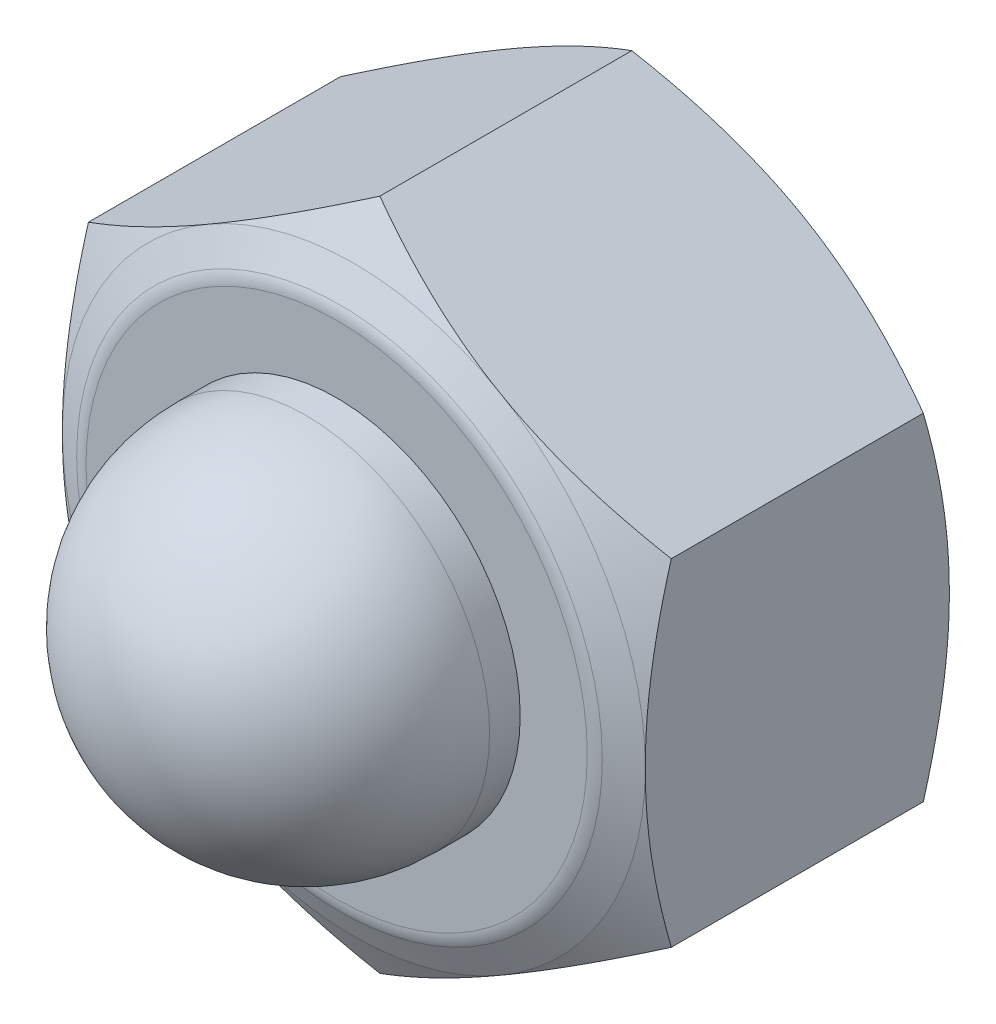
ISO-10303-21;
HEADER;
FILE_DESCRIPTION(('STEP AP214'),'2;1');
FILE_NAME('part.step','',(''),(''),'','','');
FILE_SCHEMA(('AUTOMOTIVE_DESIGN { 1 0 10303 214 1 1 1 1 }'));
ENDSEC;
DATA;
#1=APPLICATION_CONTEXT('core data for automotive mechanical design processes');
#2=APPLICATION_PROTOCOL_DEFINITION('international standard','automotive_design',2000,#1);
#3=PRODUCT_CONTEXT('',#1,'mechanical');
#4=PRODUCT('Part','Part','',(#3));
#5=PRODUCT_RELATED_PRODUCT_CATEGORY('part','',(#4));
#6=PRODUCT_DEFINITION_FORMATION('','',#4);
#7=PRODUCT_DEFINITION_CONTEXT('part definition',#1,'design');
#8=PRODUCT_DEFINITION('design','',#6,#7);
#9=PRODUCT_DEFINITION_SHAPE('','',#8);
#10=(LENGTH_UNIT() NAMED_UNIT(*) SI_UNIT(.MILLI.,.METRE.));
#11=(NAMED_UNIT(*) PLANE_ANGLE_UNIT() SI_UNIT($,.RADIAN.));
#12=(NAMED_UNIT(*) SI_UNIT($,.STERADIAN.) SOLID_ANGLE_UNIT());
#13=UNCERTAINTY_MEASURE_WITH_UNIT(LENGTH_MEASURE(1.E-05),#10,'distance_accuracy_value','');
#14=(GEOMETRIC_REPRESENTATION_CONTEXT(3) GLOBAL_UNCERTAINTY_ASSIGNED_CONTEXT((#13)) GLOBAL_UNIT_ASSIGNED_CONTEXT((#10,
#11,#12)) REPRESENTATION_CONTEXT('',''));
#15=CARTESIAN_POINT('',(0.,0.,0.));
#16=DIRECTION('',(0.,0.,1.));
#17=DIRECTION('',(1.,0.,0.));
#18=AXIS2_PLACEMENT_3D('',#15,#16,#17);
#19=CARTESIAN_POINT('',(0.,0.,-19.875));
#20=DIRECTION('',(0.,0.,1.));
#21=DIRECTION('',(1.,0.,0.));
#22=AXIS2_PLACEMENT_3D('',#19,#20,#21);
#23=CYLINDRICAL_SURFACE('',#22,11.1125);
#24=CARTESIAN_POINT('',(0.,0.,3.125));
#25=DIRECTION('',(0.,0.,1.));
#26=DIRECTION('',(1.,0.,0.));
#27=AXIS2_PLACEMENT_3D('',#24,#25,#26);
#28=CIRCLE('',#27,11.1125);
#29=CARTESIAN_POINT('',(11.1125,0.,3.125));
#30=VERTEX_POINT('',#29);
#31=EDGE_CURVE('E308',#30,#30,#28,.T.);
#32=CARTESIAN_POINT('',(0.,0.,-19.3244443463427));
#33=DIRECTION('',(0.,0.,-1.));
#34=DIRECTION('',(-1.,0.,0.));
#35=AXIS2_PLACEMENT_3D('',#32,#33,#34);
#36=CIRCLE('',#35,11.1125);
#37=CARTESIAN_POINT('',(11.1125,0.,-19.3244443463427));
#38=VERTEX_POINT('',#37);
#39=EDGE_CURVE('E42',#38,#38,#36,.F.);
#40=CARTESIAN_POINT('',(11.1125,0.,3.125));
#41=CARTESIAN_POINT('',(11.1125,0.,2.89115162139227));
#42=CARTESIAN_POINT('',(11.1125,0.,2.65730324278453));
#43=CARTESIAN_POINT('',(11.1125,0.,2.18960648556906));
#44=CARTESIAN_POINT('',(11.1125,0.,1.95575810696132));
#45=CARTESIAN_POINT('',(11.1125,0.,1.48806134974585));
#46=CARTESIAN_POINT('',(11.1125,0.,1.25421297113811));
#47=CARTESIAN_POINT('',(11.1125,0.,0.786516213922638));
#48=CARTESIAN_POINT('',(11.1125,0.,0.5526678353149));
#49=CARTESIAN_POINT('',(11.1125,0.,0.0849710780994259));
#50=CARTESIAN_POINT('',(11.1125,0.,-0.148877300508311));
#51=CARTESIAN_POINT('',(11.1125,0.,-0.616574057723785));
#52=CARTESIAN_POINT('',(11.1125,0.,-0.850422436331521));
#53=CARTESIAN_POINT('',(11.1125,0.,-1.31811919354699));
#54=CARTESIAN_POINT('',(11.1125,0.,-1.55196757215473));
#55=CARTESIAN_POINT('',(11.1125,0.,-2.0196643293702));
#56=CARTESIAN_POINT('',(11.1125,0.,-2.25351270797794));
#57=CARTESIAN_POINT('',(11.1125,0.,-2.72120946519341));
#58=CARTESIAN_POINT('',(11.1125,0.,-2.95505784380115));
#59=CARTESIAN_POINT('',(11.1125,0.,-3.42275460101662));
#60=CARTESIAN_POINT('',(11.1125,0.,-3.65660297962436));
#61=CARTESIAN_POINT('',(11.1125,0.,-4.12429973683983));
#62=CARTESIAN_POINT('',(11.1125,0.,-4.35814811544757));
#63=CARTESIAN_POINT('',(11.1125,0.,-4.82584487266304));
#64=CARTESIAN_POINT('',(11.1125,0.,-5.05969325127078));
#65=CARTESIAN_POINT('',(11.1125,0.,-5.52739000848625));
#66=CARTESIAN_POINT('',(11.1125,0.,-5.76123838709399));
#67=CARTESIAN_POINT('',(11.1125,0.,-6.22893514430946));
#68=CARTESIAN_POINT('',(11.1125,0.,-6.4627835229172));
#69=CARTESIAN_POINT('',(11.1125,0.,-6.93048028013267));
#70=CARTESIAN_POINT('',(11.1125,0.,-7.16432865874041));
#71=CARTESIAN_POINT('',(11.1125,0.,-7.63202541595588));
#72=CARTESIAN_POINT('',(11.1125,0.,-7.86587379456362));
#73=CARTESIAN_POINT('',(11.1125,0.,-8.33357055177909));
#74=CARTESIAN_POINT('',(11.1125,0.,-8.56741893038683));
#75=CARTESIAN_POINT('',(11.1125,0.,-9.0351156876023));
#76=CARTESIAN_POINT('',(11.1125,0.,-9.26896406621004));
#77=CARTESIAN_POINT('',(11.1125,0.,-9.73666082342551));
#78=CARTESIAN_POINT('',(11.1125,0.,-9.97050920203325));
#79=CARTESIAN_POINT('',(11.1125,0.,-10.4382059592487));
#80=CARTESIAN_POINT('',(11.1125,0.,-10.6720543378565));
#81=CARTESIAN_POINT('',(11.1125,0.,-11.1397510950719));
#82=CARTESIAN_POINT('',(11.1125,0.,-11.3735994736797));
#83=CARTESIAN_POINT('',(11.1125,0.,-11.8412962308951));
#84=CARTESIAN_POINT('',(11.1125,0.,-12.0751446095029));
#85=CARTESIAN_POINT('',(11.1125,0.,-12.5428413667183));
#86=CARTESIAN_POINT('',(11.1125,0.,-12.7766897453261));
#87=CARTESIAN_POINT('',(11.1125,0.,-13.2443865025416));
#88=CARTESIAN_POINT('',(11.1125,0.,-13.4782348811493));
#89=CARTESIAN_POINT('',(11.1125,0.,-13.9459316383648));
#90=CARTESIAN_POINT('',(11.1125,0.,-14.1797800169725));
#91=CARTESIAN_POINT('',(11.1125,0.,-14.647476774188));
#92=CARTESIAN_POINT('',(11.1125,0.,-14.8813251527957));
#93=CARTESIAN_POINT('',(11.1125,0.,-15.3490219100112));
#94=CARTESIAN_POINT('',(11.1125,0.,-15.5828702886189));
#95=CARTESIAN_POINT('',(11.1125,0.,-16.0505670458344));
#96=CARTESIAN_POINT('',(11.1125,0.,-16.2844154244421));
#97=CARTESIAN_POINT('',(11.1125,0.,-16.7521121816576));
#98=CARTESIAN_POINT('',(11.1125,0.,-16.9859605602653));
#99=CARTESIAN_POINT('',(11.1125,0.,-17.4536573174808));
#100=CARTESIAN_POINT('',(11.1125,0.,-17.6875056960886));
#101=CARTESIAN_POINT('',(11.1125,0.,-18.155202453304));
#102=CARTESIAN_POINT('',(11.1125,0.,-18.3890508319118));
#103=CARTESIAN_POINT('',(11.1125,0.,-18.8567475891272));
#104=CARTESIAN_POINT('',(11.1125,0.,-19.090595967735));
#105=CARTESIAN_POINT('',(11.1125,0.,-19.3244443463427));
#106=B_SPLINE_CURVE_WITH_KNOTS('',3,(#40,#41,#42,#43,#44,#45,#46,#47,#48,#49,#50,#51,#52,#53,
#54,#55,#56,#57,#58,#59,#60,#61,#62,#63,#64,#65,#66,#67,#68,#69,#70,#71,#72,#73,#74,#75,#76,#77,
#78,#79,#80,#81,#82,#83,#84,#85,#86,#87,#88,#89,#90,#91,#92,#93,#94,#95,#96,#97,#98,#99,#100,
#101,#102,#103,#104,#105),.UNSPECIFIED.,.F.,.F.,(4,2,2,2,2,2,2,2,2,2,2,2,2,2,2,2,2,2,2,2,2,2,2,
2,2,2,2,2,2,2,2,2,4),(0.,0.701545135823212,1.40309027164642,2.10463540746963,2.80618054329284,
3.50772567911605,4.20927081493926,4.91081595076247,5.61236108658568,6.31390622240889,
7.0154513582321,7.71699649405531,8.41854162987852,9.12008676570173,9.82163190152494,
10.5231770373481,11.2247221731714,11.9262673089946,12.6278124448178,13.329357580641,
14.0309027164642,14.7324478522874,15.4339929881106,16.1355381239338,16.837083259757,
17.5386283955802,18.2401735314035,18.9417186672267,19.6432638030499,20.3448089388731,
21.0463540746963,21.7478992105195,22.4494443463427),.UNSPECIFIED.);
#107=EDGE_CURVE('BSEAM37',#30,#38,#106,.T.);
#108=ORIENTED_EDGE('',*,*,#31,.T.);
#109=ORIENTED_EDGE('',*,*,#39,.F.);
#110=ORIENTED_EDGE('',*,*,#107,.T.);
#111=ORIENTED_EDGE('',*,*,#107,.F.);
#112=EDGE_LOOP('',(#108,#110,#109,#111));
#113=FACE_BOUND('',#112,.T.);
#114=ADVANCED_FACE('F37',(#113),#23,.F.);
#115=CARTESIAN_POINT('',(0.,21.9970452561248,-19.875));
#116=DIRECTION('',(-0.500000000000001,0.866025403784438,0.));
#117=DIRECTION('',(-0.866025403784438,-0.500000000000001,0.));
#118=AXIS2_PLACEMENT_3D('',#115,#116,#117);
#119=PLANE('',#118);
#120=DIRECTION('',(0.,0.,1.));
#121=VECTOR('',#120,1.);
#122=CARTESIAN_POINT('',(-19.05,10.9985226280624,-19.875));
#123=LINE('',#122,#121);
#124=CARTESIAN_POINT('',(-19.05,10.9985226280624,-18.1735226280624));
#125=VERTEX_POINT('',#124);
#126=CARTESIAN_POINT('',(-19.05,10.9985226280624,-1.70147737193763));
#127=VERTEX_POINT('',#126);
#128=EDGE_CURVE('E585',#125,#127,#123,.T.);
#129=ORIENTED_EDGE('',*,*,#128,.T.);
#130=CARTESIAN_POINT('',(-19.0502,10.9984071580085,-1.70154403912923));
#131=CARTESIAN_POINT('',(-18.6314889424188,11.2401500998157,-1.56198341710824));
#132=CARTESIAN_POINT('',(-18.2111446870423,11.4828359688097,-1.42875584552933));
#133=CARTESIAN_POINT('',(-17.3670855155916,11.9701537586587,-1.17672716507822));
#134=CARTESIAN_POINT('',(-16.9433695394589,12.2147862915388,-1.05793080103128));
#135=CARTESIAN_POINT('',(-16.0917480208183,12.7064702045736,-0.836361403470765));
#136=CARTESIAN_POINT('',(-15.6638350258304,12.9535258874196,-0.73362628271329));
#137=CARTESIAN_POINT('',(-14.8050356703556,13.4493539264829,-0.546385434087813));
#138=CARTESIAN_POINT('',(-14.374149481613,13.6981261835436,-0.461878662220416));
#139=CARTESIAN_POINT('',(-13.5204444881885,14.1910129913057,-0.314688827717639));
#140=CARTESIAN_POINT('',(-13.0976890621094,14.4350909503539,-0.251518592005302));
#141=CARTESIAN_POINT('',(-12.250241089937,14.9243652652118,-0.145596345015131));
#142=CARTESIAN_POINT('',(-11.8255485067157,15.1695616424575,-0.102844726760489));
#143=CARTESIAN_POINT('',(-10.9754499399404,15.6603662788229,-0.0388391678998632));
#144=CARTESIAN_POINT('',(-10.5500454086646,15.9059736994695,-0.0175596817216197));
#145=CARTESIAN_POINT('',(-9.6988436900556,16.397415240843,0.00304398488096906));
#146=CARTESIAN_POINT('',(-9.27304651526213,16.6432493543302,0.00236884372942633));
#147=CARTESIAN_POINT('',(-8.47700964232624,17.1028414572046,-0.0194033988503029));
#148=CARTESIAN_POINT('',(-8.10671322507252,17.316632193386,-0.037845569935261));
#149=CARTESIAN_POINT('',(-7.3670036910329,17.7437036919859,-0.0909844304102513));
#150=CARTESIAN_POINT('',(-6.99759056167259,17.9569844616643,-0.125680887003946));
#151=CARTESIAN_POINT('',(-6.25978756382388,18.3829552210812,-0.210726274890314));
#152=CARTESIAN_POINT('',(-5.89139892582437,18.5956445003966,-0.261089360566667));
#153=CARTESIAN_POINT('',(-5.1563753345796,19.0200105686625,-0.37657930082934));
#154=CARTESIAN_POINT('',(-4.7897403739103,19.2316873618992,-0.441706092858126));
#155=CARTESIAN_POINT('',(-3.67677271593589,19.8742595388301,-0.660888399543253));
#156=CARTESIAN_POINT('',(-2.93366305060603,20.3032941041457,-0.836799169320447));
#157=CARTESIAN_POINT('',(-1.45852420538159,21.1549659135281,-1.23604434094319));
#158=CARTESIAN_POINT('',(-0.726476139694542,21.5776140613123,-1.45928498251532));
#159=CARTESIAN_POINT('',(0.000199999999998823,21.9971607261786,-1.70154403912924));
#160=B_SPLINE_CURVE_WITH_KNOTS('',3,(#130,#131,#132,#133,#134,#135,#136,#137,#138,#139,#140,
#141,#142,#143,#144,#145,#146,#147,#148,#149,#150,#151,#152,#153,#154,#155,#156,#157,#158,#159),
.UNSPECIFIED.,.F.,.F.,(4,2,2,2,2,2,2,2,2,2,2,2,2,2,4),(0.,1.50971559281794,3.01992622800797,
4.53364959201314,6.04728623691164,7.52356313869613,8.99986845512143,10.4744153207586,
11.9489166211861,13.2325441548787,14.5161533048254,15.8009255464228,17.085692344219,
19.7118183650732,22.3327898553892),.UNSPECIFIED.);
#161=CARTESIAN_POINT('',(-9.52500000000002,16.4977839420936,0.));
#162=VERTEX_POINT('',#161);
#163=EDGE_CURVE('E62',#127,#162,#160,.T.);
#164=ORIENTED_EDGE('',*,*,#163,.T.);
#165=CARTESIAN_POINT('',(0.,21.9970452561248,-1.70147737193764));
#166=VERTEX_POINT('',#165);
#167=EDGE_CURVE('E163',#162,#166,#160,.T.);
#168=ORIENTED_EDGE('',*,*,#167,.T.);
#169=DIRECTION('',(0.,0.,1.));
#170=VECTOR('',#169,1.);
#171=CARTESIAN_POINT('',(0.,21.9970452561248,-19.875));
#172=LINE('',#171,#170);
#173=CARTESIAN_POINT('',(0.,21.9970452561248,-18.1735226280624));
#174=VERTEX_POINT('',#173);
#175=EDGE_CURVE('E271',#174,#166,#172,.T.);
#176=ORIENTED_EDGE('',*,*,#175,.F.);
#177=CARTESIAN_POINT('',(-19.0502,10.9984071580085,-18.1734559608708));
#178=CARTESIAN_POINT('',(-18.6314889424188,11.2401500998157,-18.3130165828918));
#179=CARTESIAN_POINT('',(-18.2111446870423,11.4828359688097,-18.4462441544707));
#180=CARTESIAN_POINT('',(-17.3670855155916,11.9701537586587,-18.6982728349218));
#181=CARTESIAN_POINT('',(-16.9433695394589,12.2147862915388,-18.8170691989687));
#182=CARTESIAN_POINT('',(-16.0917480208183,12.7064702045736,-19.0386385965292));
#183=CARTESIAN_POINT('',(-15.6638350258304,12.9535258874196,-19.1413737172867));
#184=CARTESIAN_POINT('',(-14.8050356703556,13.4493539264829,-19.3286145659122));
#185=CARTESIAN_POINT('',(-14.374149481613,13.6981261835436,-19.4131213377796));
#186=CARTESIAN_POINT('',(-13.5204444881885,14.1910129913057,-19.5603111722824));
#187=CARTESIAN_POINT('',(-13.0976890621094,14.4350909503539,-19.6234814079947));
#188=CARTESIAN_POINT('',(-12.250241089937,14.9243652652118,-19.7294036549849));
#189=CARTESIAN_POINT('',(-11.8255485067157,15.1695616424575,-19.7721552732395));
#190=CARTESIAN_POINT('',(-10.9754499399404,15.6603662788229,-19.8361608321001));
#191=CARTESIAN_POINT('',(-10.5500454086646,15.9059736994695,-19.8574403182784));
#192=CARTESIAN_POINT('',(-9.6988436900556,16.397415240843,-19.878043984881));
#193=CARTESIAN_POINT('',(-9.27304651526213,16.6432493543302,-19.8773688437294));
#194=CARTESIAN_POINT('',(-8.47700964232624,17.1028414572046,-19.8555966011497));
#195=CARTESIAN_POINT('',(-8.10671322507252,17.316632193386,-19.8371544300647));
#196=CARTESIAN_POINT('',(-7.3670036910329,17.7437036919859,-19.7840155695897));
#197=CARTESIAN_POINT('',(-6.99759056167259,17.9569844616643,-19.7493191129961));
#198=CARTESIAN_POINT('',(-6.25978756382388,18.3829552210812,-19.6642737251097));
#199=CARTESIAN_POINT('',(-5.89139892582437,18.5956445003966,-19.6139106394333));
#200=CARTESIAN_POINT('',(-5.1563753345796,19.0200105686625,-19.4984206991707));
#201=CARTESIAN_POINT('',(-4.7897403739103,19.2316873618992,-19.4332939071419));
#202=CARTESIAN_POINT('',(-3.67677271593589,19.8742595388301,-19.2141116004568));
#203=CARTESIAN_POINT('',(-2.93366305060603,20.3032941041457,-19.0382008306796));
#204=CARTESIAN_POINT('',(-1.45852420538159,21.1549659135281,-18.6389556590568));
#205=CARTESIAN_POINT('',(-0.726476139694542,21.5776140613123,-18.4157150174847));
#206=CARTESIAN_POINT('',(0.000199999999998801,21.9971607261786,-18.1734559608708));
#207=B_SPLINE_CURVE_WITH_KNOTS('',3,(#177,#178,#179,#180,#181,#182,#183,#184,#185,#186,#187,
#188,#189,#190,#191,#192,#193,#194,#195,#196,#197,#198,#199,#200,#201,#202,#203,#204,#205,#206),
.UNSPECIFIED.,.F.,.F.,(4,2,2,2,2,2,2,2,2,2,2,2,2,2,4),(0.,1.50971559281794,3.01992622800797,
4.53364959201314,6.04728623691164,7.52356313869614,8.99986845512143,10.4744153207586,
11.9489166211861,13.2325441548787,14.5161533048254,15.8009255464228,17.085692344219,
19.7118183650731,22.3327898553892),.UNSPECIFIED.);
#208=CARTESIAN_POINT('',(-9.52500000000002,16.4977839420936,-19.875));
#209=VERTEX_POINT('',#208);
#210=EDGE_CURVE('E263',#209,#174,#207,.T.);
#211=ORIENTED_EDGE('',*,*,#210,.F.);
#212=EDGE_CURVE('E255',#125,#209,#207,.T.);
#213=ORIENTED_EDGE('',*,*,#212,.F.);
#214=EDGE_LOOP('',(#129,#164,#168,#176,#211,#213));
#215=FACE_BOUND('',#214,.T.);
#216=ADVANCED_FACE('F39',(#215),#119,.T.);
#217=CARTESIAN_POINT('',(19.05,10.9985226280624,-19.875));
#218=DIRECTION('',(0.500000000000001,0.866025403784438,0.));
#219=DIRECTION('',(-0.866025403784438,0.500000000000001,0.));
#220=AXIS2_PLACEMENT_3D('',#217,#218,#219);
#221=PLANE('',#220);
#222=ORIENTED_EDGE('',*,*,#175,.T.);
#223=CARTESIAN_POINT('',(-0.000200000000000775,21.9971607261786,-1.70154403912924));
#224=CARTESIAN_POINT('',(0.418511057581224,21.7554177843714,-1.56198341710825));
#225=CARTESIAN_POINT('',(0.83885531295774,21.5127319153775,-1.42875584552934));
#226=CARTESIAN_POINT('',(1.68291448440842,21.0254141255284,-1.17672716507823));
#227=CARTESIAN_POINT('',(2.10663046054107,20.7807815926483,-1.05793080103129));
#228=CARTESIAN_POINT('',(2.95825197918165,20.2890976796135,-0.836361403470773));
#229=CARTESIAN_POINT('',(3.38616497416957,20.0420419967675,-0.733626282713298));
#230=CARTESIAN_POINT('',(4.24496432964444,19.5462139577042,-0.54638543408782));
#231=CARTESIAN_POINT('',(4.67585051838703,19.2974417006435,-0.461878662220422));
#232=CARTESIAN_POINT('',(5.52955551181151,18.8045548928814,-0.314688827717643));
#233=CARTESIAN_POINT('',(5.95231093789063,18.5604769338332,-0.251518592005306));
#234=CARTESIAN_POINT('',(6.799758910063,18.0712026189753,-0.145596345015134));
#235=CARTESIAN_POINT('',(7.22445149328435,17.8260062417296,-0.102844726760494));
#236=CARTESIAN_POINT('',(8.07455006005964,17.3352016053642,-0.0388391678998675));
#237=CARTESIAN_POINT('',(8.49995459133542,17.0895941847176,-0.0175596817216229));
#238=CARTESIAN_POINT('',(9.35115630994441,16.5981526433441,0.00304398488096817));
#239=CARTESIAN_POINT('',(9.77695348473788,16.3523185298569,0.0023688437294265));
#240=CARTESIAN_POINT('',(10.5729903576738,15.8927264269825,-0.019403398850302));
#241=CARTESIAN_POINT('',(10.9432867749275,15.6789356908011,-0.0378455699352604));
#242=CARTESIAN_POINT('',(11.6829963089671,15.2518641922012,-0.0909844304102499));
#243=CARTESIAN_POINT('',(12.0524094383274,15.0385834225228,-0.125680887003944));
#244=CARTESIAN_POINT('',(12.7902124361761,14.612612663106,-0.210726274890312));
#245=CARTESIAN_POINT('',(13.1586010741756,14.3999233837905,-0.261089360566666));
#246=CARTESIAN_POINT('',(13.8936246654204,13.9755573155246,-0.376579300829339));
#247=CARTESIAN_POINT('',(14.2602596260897,13.7638805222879,-0.441706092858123));
#248=CARTESIAN_POINT('',(15.3732272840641,13.121308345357,-0.660888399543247));
#249=CARTESIAN_POINT('',(16.116336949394,12.6922737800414,-0.83679916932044));
#250=CARTESIAN_POINT('',(17.5914757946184,11.840601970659,-1.23604434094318));
#251=CARTESIAN_POINT('',(18.3235238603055,11.4179538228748,-1.45928498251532));
#252=CARTESIAN_POINT('',(19.0502,10.9984071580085,-1.70154403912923));
#253=B_SPLINE_CURVE_WITH_KNOTS('',3,(#223,#224,#225,#226,#227,#228,#229,#230,#231,#232,#233,
#234,#235,#236,#237,#238,#239,#240,#241,#242,#243,#244,#245,#246,#247,#248,#249,#250,#251,#252),
.UNSPECIFIED.,.F.,.F.,(4,2,2,2,2,2,2,2,2,2,2,2,2,2,4),(0.,1.50971559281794,3.01992622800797,
4.53364959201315,6.04728623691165,7.52356313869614,8.99986845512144,10.4744153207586,
11.9489166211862,13.2325441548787,14.5161533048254,15.8009255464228,17.085692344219,
19.7118183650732,22.3327898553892),.UNSPECIFIED.);
#254=CARTESIAN_POINT('',(9.52500000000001,16.4977839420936,0.));
#255=VERTEX_POINT('',#254);
#256=EDGE_CURVE('E160',#166,#255,#253,.T.);
#257=ORIENTED_EDGE('',*,*,#256,.T.);
#258=CARTESIAN_POINT('',(19.05,10.9985226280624,-1.70147737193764));
#259=VERTEX_POINT('',#258);
#260=EDGE_CURVE('E152',#255,#259,#253,.T.);
#261=ORIENTED_EDGE('',*,*,#260,.T.);
#262=DIRECTION('',(0.,0.,1.));
#263=VECTOR('',#262,1.);
#264=CARTESIAN_POINT('',(19.05,10.9985226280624,-19.875));
#265=LINE('',#264,#263);
#266=CARTESIAN_POINT('',(19.05,10.9985226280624,-18.1735226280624));
#267=VERTEX_POINT('',#266);
#268=EDGE_CURVE('E159',#267,#259,#265,.T.);
#269=ORIENTED_EDGE('',*,*,#268,.F.);
#270=CARTESIAN_POINT('',(-0.000200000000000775,21.9971607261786,-18.1734559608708));
#271=CARTESIAN_POINT('',(0.418511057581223,21.7554177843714,-18.3130165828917));
#272=CARTESIAN_POINT('',(0.83885531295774,21.5127319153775,-18.4462441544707));
#273=CARTESIAN_POINT('',(1.68291448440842,21.0254141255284,-18.6982728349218));
#274=CARTESIAN_POINT('',(2.10663046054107,20.7807815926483,-18.8170691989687));
#275=CARTESIAN_POINT('',(2.95825197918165,20.2890976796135,-19.0386385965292));
#276=CARTESIAN_POINT('',(3.38616497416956,20.0420419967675,-19.1413737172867));
#277=CARTESIAN_POINT('',(4.24496432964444,19.5462139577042,-19.3286145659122));
#278=CARTESIAN_POINT('',(4.67585051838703,19.2974417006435,-19.4131213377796));
#279=CARTESIAN_POINT('',(5.52955551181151,18.8045548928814,-19.5603111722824));
#280=CARTESIAN_POINT('',(5.95231093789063,18.5604769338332,-19.6234814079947));
#281=CARTESIAN_POINT('',(6.799758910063,18.0712026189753,-19.7294036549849));
#282=CARTESIAN_POINT('',(7.22445149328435,17.8260062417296,-19.7721552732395));
#283=CARTESIAN_POINT('',(8.07455006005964,17.3352016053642,-19.8361608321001));
#284=CARTESIAN_POINT('',(8.49995459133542,17.0895941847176,-19.8574403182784));
#285=CARTESIAN_POINT('',(9.35115630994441,16.5981526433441,-19.878043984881));
#286=CARTESIAN_POINT('',(9.77695348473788,16.3523185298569,-19.8773688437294));
#287=CARTESIAN_POINT('',(10.5729903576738,15.8927264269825,-19.8555966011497));
#288=CARTESIAN_POINT('',(10.9432867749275,15.6789356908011,-19.8371544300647));
#289=CARTESIAN_POINT('',(11.6829963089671,15.2518641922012,-19.7840155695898));
#290=CARTESIAN_POINT('',(12.0524094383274,15.0385834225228,-19.7493191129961));
#291=CARTESIAN_POINT('',(12.7902124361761,14.612612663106,-19.6642737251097));
#292=CARTESIAN_POINT('',(13.1586010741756,14.3999233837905,-19.6139106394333));
#293=CARTESIAN_POINT('',(13.8936246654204,13.9755573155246,-19.4984206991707));
#294=CARTESIAN_POINT('',(14.2602596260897,13.7638805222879,-19.4332939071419));
#295=CARTESIAN_POINT('',(15.3732272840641,13.121308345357,-19.2141116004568));
#296=CARTESIAN_POINT('',(16.116336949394,12.6922737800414,-19.0382008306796));
#297=CARTESIAN_POINT('',(17.5914757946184,11.840601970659,-18.6389556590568));
#298=CARTESIAN_POINT('',(18.3235238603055,11.4179538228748,-18.4157150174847));
#299=CARTESIAN_POINT('',(19.0502,10.9984071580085,-18.1734559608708));
#300=B_SPLINE_CURVE_WITH_KNOTS('',3,(#270,#271,#272,#273,#274,#275,#276,#277,#278,#279,#280,
#281,#282,#283,#284,#285,#286,#287,#288,#289,#290,#291,#292,#293,#294,#295,#296,#297,#298,#299),
.UNSPECIFIED.,.F.,.F.,(4,2,2,2,2,2,2,2,2,2,2,2,2,2,4),(0.,1.50971559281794,3.01992622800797,
4.53364959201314,6.04728623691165,7.52356313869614,8.99986845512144,10.4744153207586,
11.9489166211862,13.2325441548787,14.5161533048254,15.8009255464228,17.085692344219,
19.7118183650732,22.3327898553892),.UNSPECIFIED.);
#301=CARTESIAN_POINT('',(9.52500000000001,16.4977839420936,-19.875));
#302=VERTEX_POINT('',#301);
#303=EDGE_CURVE('E264',#302,#267,#300,.T.);
#304=ORIENTED_EDGE('',*,*,#303,.F.);
#305=EDGE_CURVE('E270',#174,#302,#300,.T.);
#306=ORIENTED_EDGE('',*,*,#305,.F.);
#307=EDGE_LOOP('',(#222,#257,#261,#269,#304,#306));
#308=FACE_BOUND('',#307,.T.);
#309=ADVANCED_FACE('F273',(#308),#221,.T.);
#310=CARTESIAN_POINT('',(19.05,10.9985226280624,-19.875));
#311=DIRECTION('',(-1.,0.,0.));
#312=DIRECTION('',(0.,0.,1.));
#313=AXIS2_PLACEMENT_3D('',#310,#311,#312);
#314=PLANE('',#313);
#315=CARTESIAN_POINT('',(19.05,-29.169702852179,-9.1159337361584));
#316=CARTESIAN_POINT('',(19.05,-28.7515170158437,-8.91378890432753));
#317=CARTESIAN_POINT('',(19.05,-28.3328257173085,-8.71269026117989));
#318=CARTESIAN_POINT('',(19.05,-27.494325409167,-8.31282549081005));
#319=CARTESIAN_POINT('',(19.05,-27.0745163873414,-8.11405938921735));
#320=CARTESIAN_POINT('',(19.05,-25.8131296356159,-7.52156252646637));
#321=CARTESIAN_POINT('',(19.05,-24.9697281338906,-7.1316990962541));
#322=CARTESIAN_POINT('',(19.05,-23.2722707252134,-6.36257122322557));
#323=CARTESIAN_POINT('',(19.05,-22.4181814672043,-5.98338020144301));
#324=CARTESIAN_POINT('',(19.05,-20.7029839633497,-5.24127883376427));
#325=CARTESIAN_POINT('',(19.05,-19.8418760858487,-4.87836763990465));
#326=CARTESIAN_POINT('',(19.05,-18.1005821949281,-4.16885698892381));
#327=CARTESIAN_POINT('',(19.05,-17.2202917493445,-3.82251248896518));
#328=CARTESIAN_POINT('',(19.05,-15.4493217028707,-3.15694792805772));
#329=CARTESIAN_POINT('',(19.05,-14.5586409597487,-2.83773088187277));
#330=CARTESIAN_POINT('',(19.05,-12.7673320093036,-2.2350028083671));
#331=CARTESIAN_POINT('',(19.05,-11.8667295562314,-1.95141586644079));
#332=CARTESIAN_POINT('',(19.05,-10.0526343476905,-1.42914392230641));
#333=CARTESIAN_POINT('',(19.05,-9.13914576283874,-1.19044473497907));
#334=CARTESIAN_POINT('',(19.05,-7.75907469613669,-0.874799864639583));
#335=CARTESIAN_POINT('',(19.05,-7.29731333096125,-0.776636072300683));
#336=CARTESIAN_POINT('',(19.05,-6.37071732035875,-0.59599319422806));
#337=CARTESIAN_POINT('',(19.05,-5.90588274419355,-0.51351375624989));
#338=CARTESIAN_POINT('',(19.05,-4.97345228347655,-0.365701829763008));
#339=CARTESIAN_POINT('',(19.05,-4.50585623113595,-0.300370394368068));
#340=CARTESIAN_POINT('',(19.05,-3.56843861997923,-0.188166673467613));
#341=CARTESIAN_POINT('',(19.05,-3.09861705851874,-0.141294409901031));
#342=CARTESIAN_POINT('',(19.05,-2.16041609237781,-0.0672708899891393));
#343=CARTESIAN_POINT('',(19.05,-1.6920464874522,-0.0399962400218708));
#344=CARTESIAN_POINT('',(19.05,-0.754574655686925,-0.00531133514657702));
#345=CARTESIAN_POINT('',(19.05,-0.285472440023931,0.00209921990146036));
#346=CARTESIAN_POINT('',(19.05,0.652492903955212,-0.00311981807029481));
#347=CARTESIAN_POINT('',(19.05,1.1213560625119,-0.0157438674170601));
#348=CARTESIAN_POINT('',(19.05,2.05813737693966,-0.0607182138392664));
#349=CARTESIAN_POINT('',(19.05,2.52605549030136,-0.0930693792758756));
#350=CARTESIAN_POINT('',(19.05,3.65980250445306,-0.194680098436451));
#351=CARTESIAN_POINT('',(19.05,4.32476458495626,-0.273803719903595));
#352=CARTESIAN_POINT('',(19.05,5.64947952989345,-0.467485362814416));
#353=CARTESIAN_POINT('',(19.05,6.30923160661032,-0.58204864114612));
#354=CARTESIAN_POINT('',(19.05,8.2818238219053,-0.973151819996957));
#355=CARTESIAN_POINT('',(19.05,9.58542312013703,-1.29684470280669));
#356=CARTESIAN_POINT('',(19.05,11.5353898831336,-1.85499845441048));
#357=CARTESIAN_POINT('',(19.05,12.191945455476,-2.05588340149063));
#358=CARTESIAN_POINT('',(19.05,13.498713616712,-2.47768236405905));
#359=CARTESIAN_POINT('',(19.05,14.1489256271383,-2.69859818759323));
#360=CARTESIAN_POINT('',(19.05,15.4397656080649,-3.15575174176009));
#361=CARTESIAN_POINT('',(19.05,16.0804269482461,-3.39189604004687));
#362=CARTESIAN_POINT('',(19.05,17.0373840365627,-3.75633654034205));
#363=CARTESIAN_POINT('',(19.05,17.3556458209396,-3.87949985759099));
#364=CARTESIAN_POINT('',(19.05,17.9909330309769,-4.1289579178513));
#365=CARTESIAN_POINT('',(19.05,18.3079584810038,-4.25525259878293));
#366=CARTESIAN_POINT('',(19.05,18.6244086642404,-4.38297164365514));
#367=B_SPLINE_CURVE_WITH_KNOTS('',3,(#315,#316,#317,#318,#319,#320,#321,#322,#323,#324,#325,
#326,#327,#328,#329,#330,#331,#332,#333,#334,#335,#336,#337,#338,#339,#340,#341,#342,#343,#344,
#345,#346,#347,#348,#349,#350,#351,#352,#353,#354,#355,#356,#357,#358,#359,#360,#361,#362,#363,
#364,#365,#366),.UNSPECIFIED.,.F.,.F.,(4,2,2,2,2,2,2,2,2,2,2,2,2,2,2,2,2,2,2,2,2,2,2,2,2,4),(0.,
1.39343811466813,2.78689152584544,5.57425145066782,8.37756231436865,11.1807269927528,
14.0183059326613,16.856199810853,19.6879407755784,22.5187853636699,23.934802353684,
25.3507875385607,26.766859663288,28.1829334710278,29.5900111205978,30.9970675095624,
32.4037346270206,33.8104636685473,35.8182820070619,37.8263983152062,41.8503661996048,
43.910005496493,45.9698308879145,48.0180400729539,49.0418117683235,50.0655631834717),.UNSPECIFIED.);
#368=CARTESIAN_POINT('',(19.05,-10.9985226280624,-1.70147737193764));
#369=VERTEX_POINT('',#368);
#370=CARTESIAN_POINT('',(19.05,0.,0.));
#371=VERTEX_POINT('',#370);
#372=EDGE_CURVE('E140',#369,#371,#367,.T.);
#373=ORIENTED_EDGE('',*,*,#372,.F.);
#374=DIRECTION('',(0.,0.,1.));
#375=VECTOR('',#374,1.);
#376=CARTESIAN_POINT('',(19.05,-10.9985226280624,-19.875));
#377=LINE('',#376,#375);
#378=CARTESIAN_POINT('',(19.05,-10.9985226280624,-18.1735226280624));
#379=VERTEX_POINT('',#378);
#380=EDGE_CURVE('E588',#379,#369,#377,.T.);
#381=ORIENTED_EDGE('',*,*,#380,.F.);
#382=CARTESIAN_POINT('',(19.05,-29.169702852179,-10.7590662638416));
#383=CARTESIAN_POINT('',(19.05,-28.7515170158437,-10.9612110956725));
#384=CARTESIAN_POINT('',(19.05,-28.3328257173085,-11.1623097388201));
#385=CARTESIAN_POINT('',(19.05,-27.494325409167,-11.5621745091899));
#386=CARTESIAN_POINT('',(19.05,-27.0745163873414,-11.7609406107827));
#387=CARTESIAN_POINT('',(19.05,-25.8131296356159,-12.3534374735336));
#388=CARTESIAN_POINT('',(19.05,-24.9697281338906,-12.7433009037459));
#389=CARTESIAN_POINT('',(19.05,-23.2722707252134,-13.5124287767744));
#390=CARTESIAN_POINT('',(19.05,-22.4181814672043,-13.891619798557));
#391=CARTESIAN_POINT('',(19.05,-20.7029839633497,-14.6337211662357));
#392=CARTESIAN_POINT('',(19.05,-19.8418760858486,-14.9966323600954));
#393=CARTESIAN_POINT('',(19.05,-18.1005821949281,-15.7061430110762));
#394=CARTESIAN_POINT('',(19.05,-17.2202917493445,-16.0524875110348));
#395=CARTESIAN_POINT('',(19.05,-15.4493217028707,-16.7180520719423));
#396=CARTESIAN_POINT('',(19.05,-14.5586409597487,-17.0372691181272));
#397=CARTESIAN_POINT('',(19.05,-12.7673320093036,-17.6399971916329));
#398=CARTESIAN_POINT('',(19.05,-11.8667295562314,-17.9235841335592));
#399=CARTESIAN_POINT('',(19.05,-10.0526343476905,-18.4458560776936));
#400=CARTESIAN_POINT('',(19.05,-9.13914576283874,-18.6845552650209));
#401=CARTESIAN_POINT('',(19.05,-7.75907469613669,-19.0002001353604));
#402=CARTESIAN_POINT('',(19.05,-7.29731333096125,-19.0983639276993));
#403=CARTESIAN_POINT('',(19.05,-6.37071732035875,-19.2790068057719));
#404=CARTESIAN_POINT('',(19.05,-5.90588274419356,-19.3614862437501));
#405=CARTESIAN_POINT('',(19.05,-4.97345228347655,-19.509298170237));
#406=CARTESIAN_POINT('',(19.05,-4.50585623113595,-19.5746296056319));
#407=CARTESIAN_POINT('',(19.05,-3.56843861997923,-19.6868333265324));
#408=CARTESIAN_POINT('',(19.05,-3.09861705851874,-19.733705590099));
#409=CARTESIAN_POINT('',(19.05,-2.16041609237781,-19.8077291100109));
#410=CARTESIAN_POINT('',(19.05,-1.6920464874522,-19.8350037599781));
#411=CARTESIAN_POINT('',(19.05,-0.754574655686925,-19.8696886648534));
#412=CARTESIAN_POINT('',(19.05,-0.285472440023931,-19.8770992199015));
#413=CARTESIAN_POINT('',(19.05,0.652492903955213,-19.8718801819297));
#414=CARTESIAN_POINT('',(19.05,1.1213560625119,-19.8592561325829));
#415=CARTESIAN_POINT('',(19.05,2.05813737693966,-19.8142817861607));
#416=CARTESIAN_POINT('',(19.05,2.52605549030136,-19.7819306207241));
#417=CARTESIAN_POINT('',(19.05,3.65980250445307,-19.6803199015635));
#418=CARTESIAN_POINT('',(19.05,4.32476458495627,-19.6011962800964));
#419=CARTESIAN_POINT('',(19.05,5.64947952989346,-19.4075146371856));
#420=CARTESIAN_POINT('',(19.05,6.30923160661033,-19.2929513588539));
#421=CARTESIAN_POINT('',(19.05,8.28182382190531,-18.901848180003));
#422=CARTESIAN_POINT('',(19.05,9.58542312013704,-18.5781552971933));
#423=CARTESIAN_POINT('',(19.05,11.5353898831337,-18.0200015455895));
#424=CARTESIAN_POINT('',(19.05,12.191945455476,-17.8191165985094));
#425=CARTESIAN_POINT('',(19.05,13.498713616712,-17.3973176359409));
#426=CARTESIAN_POINT('',(19.05,14.1489256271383,-17.1764018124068));
#427=CARTESIAN_POINT('',(19.05,15.4397656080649,-16.7192482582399));
#428=CARTESIAN_POINT('',(19.05,16.0804269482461,-16.4831039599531));
#429=CARTESIAN_POINT('',(19.05,17.0373840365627,-16.1186634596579));
#430=CARTESIAN_POINT('',(19.05,17.3556458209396,-15.995500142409));
#431=CARTESIAN_POINT('',(19.05,17.9909330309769,-15.7460420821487));
#432=CARTESIAN_POINT('',(19.05,18.3079584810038,-15.6197474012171));
#433=CARTESIAN_POINT('',(19.05,18.6244086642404,-15.4920283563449));
#434=B_SPLINE_CURVE_WITH_KNOTS('',3,(#382,#383,#384,#385,#386,#387,#388,#389,#390,#391,#392,
#393,#394,#395,#396,#397,#398,#399,#400,#401,#402,#403,#404,#405,#406,#407,#408,#409,#410,#411,
#412,#413,#414,#415,#416,#417,#418,#419,#420,#421,#422,#423,#424,#425,#426,#427,#428,#429,#430,
#431,#432,#433),.UNSPECIFIED.,.F.,.F.,(4,2,2,2,2,2,2,2,2,2,2,2,2,2,2,2,2,2,2,2,2,2,2,2,2,4),(0.,
1.39343811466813,2.78689152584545,5.57425145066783,8.37756231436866,11.1807269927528,
14.0183059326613,16.856199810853,19.6879407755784,22.5187853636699,23.934802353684,
25.3507875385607,26.766859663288,28.1829334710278,29.5900111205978,30.9970675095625,
32.4037346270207,33.8104636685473,35.8182820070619,37.8263983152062,41.8503661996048,
43.910005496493,45.9698308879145,48.0180400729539,49.0418117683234,50.0655631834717),.UNSPECIFIED.);
#435=CARTESIAN_POINT('',(19.05,0.,-19.875));
#436=VERTEX_POINT('',#435);
#437=EDGE_CURVE('E248',#379,#436,#434,.T.);
#438=ORIENTED_EDGE('',*,*,#437,.T.);
#439=EDGE_CURVE('E256',#436,#267,#434,.T.);
#440=ORIENTED_EDGE('',*,*,#439,.T.);
#441=ORIENTED_EDGE('',*,*,#268,.T.);
#442=EDGE_CURVE('E148',#371,#259,#367,.T.);
#443=ORIENTED_EDGE('',*,*,#442,.F.);
#444=EDGE_LOOP('',(#373,#381,#438,#440,#441,#443));
#445=FACE_BOUND('',#444,.T.);
#446=ADVANCED_FACE('F156',(#445),#314,.F.);
#447=CARTESIAN_POINT('',(0.,-21.9970452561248,-19.875));
#448=DIRECTION('',(0.500000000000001,-0.866025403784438,0.));
#449=DIRECTION('',(0.866025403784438,0.500000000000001,0.));
#450=AXIS2_PLACEMENT_3D('',#447,#448,#449);
#451=PLANE('',#450);
#452=ORIENTED_EDGE('',*,*,#380,.T.);
#453=CARTESIAN_POINT('',(19.0502,-10.9984071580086,-1.70154403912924));
#454=CARTESIAN_POINT('',(18.6314889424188,-11.2401500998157,-1.56198341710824));
#455=CARTESIAN_POINT('',(18.2111446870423,-11.4828359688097,-1.42875584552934));
#456=CARTESIAN_POINT('',(17.3670855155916,-11.9701537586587,-1.17672716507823));
#457=CARTESIAN_POINT('',(16.9433695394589,-12.2147862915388,-1.05793080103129));
#458=CARTESIAN_POINT('',(16.0917480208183,-12.7064702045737,-0.836361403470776));
#459=CARTESIAN_POINT('',(15.6638350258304,-12.9535258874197,-0.733626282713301));
#460=CARTESIAN_POINT('',(14.8050356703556,-13.449353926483,-0.546385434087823));
#461=CARTESIAN_POINT('',(14.374149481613,-13.6981261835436,-0.461878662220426));
#462=CARTESIAN_POINT('',(13.5204444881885,-14.1910129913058,-0.31468882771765));
#463=CARTESIAN_POINT('',(13.0976890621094,-14.4350909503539,-0.251518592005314));
#464=CARTESIAN_POINT('',(12.250241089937,-14.9243652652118,-0.145596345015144));
#465=CARTESIAN_POINT('',(11.8255485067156,-15.1695616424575,-0.102844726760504));
#466=CARTESIAN_POINT('',(10.9754499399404,-15.6603662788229,-0.0388391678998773));
#467=CARTESIAN_POINT('',(10.5500454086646,-15.9059736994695,-0.0175596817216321));
#468=CARTESIAN_POINT('',(9.69884369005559,-16.3974152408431,0.00304398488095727));
#469=CARTESIAN_POINT('',(9.27304651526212,-16.6432493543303,0.0023688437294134));
#470=CARTESIAN_POINT('',(8.47700964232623,-17.1028414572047,-0.0194033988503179));
#471=CARTESIAN_POINT('',(8.10671322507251,-17.3166321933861,-0.0378455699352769));
#472=CARTESIAN_POINT('',(7.36700369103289,-17.743703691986,-0.0909844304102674));
#473=CARTESIAN_POINT('',(6.99759056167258,-17.9569844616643,-0.125680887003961));
#474=CARTESIAN_POINT('',(6.25978756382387,-18.3829552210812,-0.21072627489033));
#475=CARTESIAN_POINT('',(5.89139892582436,-18.5956445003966,-0.261089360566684));
#476=CARTESIAN_POINT('',(5.1563753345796,-19.0200105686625,-0.376579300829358));
#477=CARTESIAN_POINT('',(4.7897403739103,-19.2316873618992,-0.441706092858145));
#478=CARTESIAN_POINT('',(3.67677271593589,-19.8742595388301,-0.660888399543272));
#479=CARTESIAN_POINT('',(2.93366305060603,-20.3032941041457,-0.836799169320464));
#480=CARTESIAN_POINT('',(1.45852420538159,-21.1549659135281,-1.2360443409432));
#481=CARTESIAN_POINT('',(0.726476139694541,-21.5776140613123,-1.45928498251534));
#482=CARTESIAN_POINT('',(-0.000199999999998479,-21.9971607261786,-1.70154403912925));
#483=B_SPLINE_CURVE_WITH_KNOTS('',3,(#453,#454,#455,#456,#457,#458,#459,#460,#461,#462,#463,
#464,#465,#466,#467,#468,#469,#470,#471,#472,#473,#474,#475,#476,#477,#478,#479,#480,#481,#482),
.UNSPECIFIED.,.F.,.F.,(4,2,2,2,2,2,2,2,2,2,2,2,2,2,4),(0.,1.50971559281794,3.01992622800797,
4.53364959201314,6.04728623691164,7.52356313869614,8.99986845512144,10.4744153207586,
11.9489166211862,13.2325441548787,14.5161533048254,15.8009255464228,17.085692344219,
19.7118183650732,22.3327898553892),.UNSPECIFIED.);
#484=CARTESIAN_POINT('',(9.52500000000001,-16.4977839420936,0.));
#485=VERTEX_POINT('',#484);
#486=EDGE_CURVE('E142',#369,#485,#483,.T.);
#487=ORIENTED_EDGE('',*,*,#486,.T.);
#488=CARTESIAN_POINT('',(0.,-21.9970452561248,-1.70147737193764));
#489=VERTEX_POINT('',#488);
#490=EDGE_CURVE('E171',#485,#489,#483,.T.);
#491=ORIENTED_EDGE('',*,*,#490,.T.);
#492=DIRECTION('',(0.,0.,1.));
#493=VECTOR('',#492,1.);
#494=CARTESIAN_POINT('',(0.,-21.9970452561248,-19.875));
#495=LINE('',#494,#493);
#496=CARTESIAN_POINT('',(0.,-21.9970452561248,-18.1735226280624));
#497=VERTEX_POINT('',#496);
#498=EDGE_CURVE('E597',#497,#489,#495,.T.);
#499=ORIENTED_EDGE('',*,*,#498,.F.);
#500=CARTESIAN_POINT('',(19.0502,-10.9984071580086,-18.1734559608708));
#501=CARTESIAN_POINT('',(18.6314889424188,-11.2401500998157,-18.3130165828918));
#502=CARTESIAN_POINT('',(18.2111446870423,-11.4828359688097,-18.4462441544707));
#503=CARTESIAN_POINT('',(17.3670855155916,-11.9701537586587,-18.6982728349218));
#504=CARTESIAN_POINT('',(16.9433695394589,-12.2147862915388,-18.8170691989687));
#505=CARTESIAN_POINT('',(16.0917480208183,-12.7064702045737,-19.0386385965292));
#506=CARTESIAN_POINT('',(15.6638350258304,-12.9535258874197,-19.1413737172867));
#507=CARTESIAN_POINT('',(14.8050356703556,-13.449353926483,-19.3286145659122));
#508=CARTESIAN_POINT('',(14.374149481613,-13.6981261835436,-19.4131213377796));
#509=CARTESIAN_POINT('',(13.5204444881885,-14.1910129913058,-19.5603111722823));
#510=CARTESIAN_POINT('',(13.0976890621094,-14.4350909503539,-19.6234814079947));
#511=CARTESIAN_POINT('',(12.250241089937,-14.9243652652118,-19.7294036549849));
#512=CARTESIAN_POINT('',(11.8255485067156,-15.1695616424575,-19.7721552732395));
#513=CARTESIAN_POINT('',(10.9754499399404,-15.6603662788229,-19.8361608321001));
#514=CARTESIAN_POINT('',(10.5500454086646,-15.9059736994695,-19.8574403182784));
#515=CARTESIAN_POINT('',(9.69884369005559,-16.3974152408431,-19.878043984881));
#516=CARTESIAN_POINT('',(9.27304651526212,-16.6432493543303,-19.8773688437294));
#517=CARTESIAN_POINT('',(8.47700964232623,-17.1028414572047,-19.8555966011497));
#518=CARTESIAN_POINT('',(8.10671322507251,-17.3166321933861,-19.8371544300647));
#519=CARTESIAN_POINT('',(7.36700369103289,-17.743703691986,-19.7840155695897));
#520=CARTESIAN_POINT('',(6.99759056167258,-17.9569844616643,-19.749319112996));
#521=CARTESIAN_POINT('',(6.25978756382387,-18.3829552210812,-19.6642737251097));
#522=CARTESIAN_POINT('',(5.89139892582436,-18.5956445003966,-19.6139106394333));
#523=CARTESIAN_POINT('',(5.1563753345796,-19.0200105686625,-19.4984206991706));
#524=CARTESIAN_POINT('',(4.7897403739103,-19.2316873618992,-19.4332939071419));
#525=CARTESIAN_POINT('',(3.67677271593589,-19.8742595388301,-19.2141116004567));
#526=CARTESIAN_POINT('',(2.93366305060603,-20.3032941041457,-19.0382008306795));
#527=CARTESIAN_POINT('',(1.45852420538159,-21.1549659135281,-18.6389556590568));
#528=CARTESIAN_POINT('',(0.726476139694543,-21.5776140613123,-18.4157150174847));
#529=CARTESIAN_POINT('',(-0.000199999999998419,-21.9971607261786,-18.1734559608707));
#530=B_SPLINE_CURVE_WITH_KNOTS('',3,(#500,#501,#502,#503,#504,#505,#506,#507,#508,#509,#510,
#511,#512,#513,#514,#515,#516,#517,#518,#519,#520,#521,#522,#523,#524,#525,#526,#527,#528,#529),
.UNSPECIFIED.,.F.,.F.,(4,2,2,2,2,2,2,2,2,2,2,2,2,2,4),(0.,1.50971559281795,3.01992622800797,
4.53364959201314,6.04728623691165,7.52356313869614,8.99986845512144,10.4744153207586,
11.9489166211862,13.2325441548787,14.5161533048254,15.8009255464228,17.085692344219,
19.7118183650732,22.3327898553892),.UNSPECIFIED.);
#531=CARTESIAN_POINT('',(9.52500000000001,-16.4977839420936,-19.875));
#532=VERTEX_POINT('',#531);
#533=EDGE_CURVE('E241',#532,#497,#530,.T.);
#534=ORIENTED_EDGE('',*,*,#533,.F.);
#535=EDGE_CURVE('E247',#379,#532,#530,.T.);
#536=ORIENTED_EDGE('',*,*,#535,.F.);
#537=EDGE_LOOP('',(#452,#487,#491,#499,#534,#536));
#538=FACE_BOUND('',#537,.T.);
#539=ADVANCED_FACE('F220',(#538),#451,.T.);
#540=CARTESIAN_POINT('',(-19.05,-10.9985226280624,-19.875));
#541=DIRECTION('',(-0.500000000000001,-0.866025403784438,0.));
#542=DIRECTION('',(0.866025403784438,-0.500000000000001,0.));
#543=AXIS2_PLACEMENT_3D('',#540,#541,#542);
#544=PLANE('',#543);
#545=ORIENTED_EDGE('',*,*,#498,.T.);
#546=CARTESIAN_POINT('',(0.000200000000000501,-21.9971607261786,-1.70154403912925));
#547=CARTESIAN_POINT('',(-0.418511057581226,-21.7554177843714,-1.56198341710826));
#548=CARTESIAN_POINT('',(-0.838855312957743,-21.5127319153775,-1.42875584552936));
#549=CARTESIAN_POINT('',(-1.68291448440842,-21.0254141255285,-1.17672716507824));
#550=CARTESIAN_POINT('',(-2.10663046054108,-20.7807815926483,-1.0579308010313));
#551=CARTESIAN_POINT('',(-2.95825197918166,-20.2890976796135,-0.836361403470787));
#552=CARTESIAN_POINT('',(-3.38616497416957,-20.0420419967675,-0.733626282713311));
#553=CARTESIAN_POINT('',(-4.24496432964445,-19.5462139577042,-0.546385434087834));
#554=CARTESIAN_POINT('',(-4.67585051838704,-19.2974417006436,-0.461878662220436));
#555=CARTESIAN_POINT('',(-5.52955551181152,-18.8045548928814,-0.314688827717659));
#556=CARTESIAN_POINT('',(-5.95231093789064,-18.5604769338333,-0.251518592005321));
#557=CARTESIAN_POINT('',(-6.79975891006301,-18.0712026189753,-0.145596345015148));
#558=CARTESIAN_POINT('',(-7.22445149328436,-17.8260062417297,-0.102844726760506));
#559=CARTESIAN_POINT('',(-8.07455006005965,-17.3352016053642,-0.0388391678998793));
#560=CARTESIAN_POINT('',(-8.49995459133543,-17.0895941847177,-0.0175596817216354));
#561=CARTESIAN_POINT('',(-9.35115630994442,-16.5981526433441,0.00304398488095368));
#562=CARTESIAN_POINT('',(-9.77695348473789,-16.3523185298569,0.00236884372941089));
#563=CARTESIAN_POINT('',(-10.5729903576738,-15.8927264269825,-0.0194033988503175));
#564=CARTESIAN_POINT('',(-10.9432867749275,-15.6789356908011,-0.0378455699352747));
#565=CARTESIAN_POINT('',(-11.6829963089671,-15.2518641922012,-0.0909844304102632));
#566=CARTESIAN_POINT('',(-12.0524094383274,-15.0385834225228,-0.125680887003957));
#567=CARTESIAN_POINT('',(-12.7902124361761,-14.612612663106,-0.210726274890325));
#568=CARTESIAN_POINT('',(-13.1586010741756,-14.3999233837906,-0.261089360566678));
#569=CARTESIAN_POINT('',(-13.8936246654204,-13.9755573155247,-0.37657930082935));
#570=CARTESIAN_POINT('',(-14.2602596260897,-13.7638805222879,-0.441706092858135));
#571=CARTESIAN_POINT('',(-15.3732272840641,-13.121308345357,-0.66088839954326));
#572=CARTESIAN_POINT('',(-16.116336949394,-12.6922737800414,-0.836799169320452));
#573=CARTESIAN_POINT('',(-17.5914757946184,-11.840601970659,-1.23604434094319));
#574=CARTESIAN_POINT('',(-18.3235238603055,-11.4179538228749,-1.45928498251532));
#575=CARTESIAN_POINT('',(-19.0502,-10.9984071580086,-1.70154403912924));
#576=B_SPLINE_CURVE_WITH_KNOTS('',3,(#546,#547,#548,#549,#550,#551,#552,#553,#554,#555,#556,
#557,#558,#559,#560,#561,#562,#563,#564,#565,#566,#567,#568,#569,#570,#571,#572,#573,#574,#575),
.UNSPECIFIED.,.F.,.F.,(4,2,2,2,2,2,2,2,2,2,2,2,2,2,4),(0.,1.50971559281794,3.01992622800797,
4.53364959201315,6.04728623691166,7.52356313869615,8.99986845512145,10.4744153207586,
11.9489166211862,13.2325441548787,14.5161533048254,15.8009255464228,17.085692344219,
19.7118183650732,22.3327898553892),.UNSPECIFIED.);
#577=CARTESIAN_POINT('',(-9.52500000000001,-16.4977839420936,0.));
#578=VERTEX_POINT('',#577);
#579=EDGE_CURVE('E214',#489,#578,#576,.T.);
#580=ORIENTED_EDGE('',*,*,#579,.T.);
#581=CARTESIAN_POINT('',(-19.05,-10.9985226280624,-1.70147737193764));
#582=VERTEX_POINT('',#581);
#583=EDGE_CURVE('E206',#578,#582,#576,.T.);
#584=ORIENTED_EDGE('',*,*,#583,.T.);
#585=DIRECTION('',(0.,0.,1.));
#586=VECTOR('',#585,1.);
#587=CARTESIAN_POINT('',(-19.05,-10.9985226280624,-19.875));
#588=LINE('',#587,#586);
#589=CARTESIAN_POINT('',(-19.05,-10.9985226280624,-18.1735226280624));
#590=VERTEX_POINT('',#589);
#591=EDGE_CURVE('E586',#590,#582,#588,.T.);
#592=ORIENTED_EDGE('',*,*,#591,.F.);
#593=CARTESIAN_POINT('',(0.000200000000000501,-21.9971607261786,-18.1734559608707));
#594=CARTESIAN_POINT('',(-0.418511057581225,-21.7554177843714,-18.3130165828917));
#595=CARTESIAN_POINT('',(-0.838855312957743,-21.5127319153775,-18.4462441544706));
#596=CARTESIAN_POINT('',(-1.68291448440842,-21.0254141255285,-18.6982728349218));
#597=CARTESIAN_POINT('',(-2.10663046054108,-20.7807815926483,-18.8170691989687));
#598=CARTESIAN_POINT('',(-2.95825197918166,-20.2890976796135,-19.0386385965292));
#599=CARTESIAN_POINT('',(-3.38616497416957,-20.0420419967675,-19.1413737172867));
#600=CARTESIAN_POINT('',(-4.24496432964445,-19.5462139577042,-19.3286145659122));
#601=CARTESIAN_POINT('',(-4.67585051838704,-19.2974417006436,-19.4131213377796));
#602=CARTESIAN_POINT('',(-5.52955551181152,-18.8045548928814,-19.5603111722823));
#603=CARTESIAN_POINT('',(-5.95231093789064,-18.5604769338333,-19.6234814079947));
#604=CARTESIAN_POINT('',(-6.79975891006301,-18.0712026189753,-19.7294036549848));
#605=CARTESIAN_POINT('',(-7.22445149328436,-17.8260062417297,-19.7721552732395));
#606=CARTESIAN_POINT('',(-8.07455006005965,-17.3352016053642,-19.8361608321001));
#607=CARTESIAN_POINT('',(-8.49995459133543,-17.0895941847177,-19.8574403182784));
#608=CARTESIAN_POINT('',(-9.35115630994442,-16.5981526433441,-19.878043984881));
#609=CARTESIAN_POINT('',(-9.77695348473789,-16.3523185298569,-19.8773688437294));
#610=CARTESIAN_POINT('',(-10.5729903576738,-15.8927264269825,-19.8555966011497));
#611=CARTESIAN_POINT('',(-10.9432867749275,-15.6789356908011,-19.8371544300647));
#612=CARTESIAN_POINT('',(-11.6829963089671,-15.2518641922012,-19.7840155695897));
#613=CARTESIAN_POINT('',(-12.0524094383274,-15.0385834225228,-19.749319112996));
#614=CARTESIAN_POINT('',(-12.7902124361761,-14.612612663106,-19.6642737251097));
#615=CARTESIAN_POINT('',(-13.1586010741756,-14.3999233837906,-19.6139106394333));
#616=CARTESIAN_POINT('',(-13.8936246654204,-13.9755573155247,-19.4984206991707));
#617=CARTESIAN_POINT('',(-14.2602596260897,-13.7638805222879,-19.4332939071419));
#618=CARTESIAN_POINT('',(-15.3732272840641,-13.1213083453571,-19.2141116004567));
#619=CARTESIAN_POINT('',(-16.116336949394,-12.6922737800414,-19.0382008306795));
#620=CARTESIAN_POINT('',(-17.5914757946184,-11.840601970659,-18.6389556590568));
#621=CARTESIAN_POINT('',(-18.3235238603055,-11.4179538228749,-18.4157150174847));
#622=CARTESIAN_POINT('',(-19.0502,-10.9984071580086,-18.1734559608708));
#623=B_SPLINE_CURVE_WITH_KNOTS('',3,(#593,#594,#595,#596,#597,#598,#599,#600,#601,#602,#603,
#604,#605,#606,#607,#608,#609,#610,#611,#612,#613,#614,#615,#616,#617,#618,#619,#620,#621,#622),
.UNSPECIFIED.,.F.,.F.,(4,2,2,2,2,2,2,2,2,2,2,2,2,2,4),(0.,1.50971559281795,3.01992622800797,
4.53364959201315,6.04728623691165,7.52356313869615,8.99986845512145,10.4744153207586,
11.9489166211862,13.2325441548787,14.5161533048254,15.8009255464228,17.085692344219,
19.7118183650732,22.3327898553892),.UNSPECIFIED.);
#624=CARTESIAN_POINT('',(-9.52500000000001,-16.4977839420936,-19.875));
#625=VERTEX_POINT('',#624);
#626=EDGE_CURVE('E226',#625,#590,#623,.T.);
#627=ORIENTED_EDGE('',*,*,#626,.F.);
#628=EDGE_CURVE('E233',#497,#625,#623,.T.);
#629=ORIENTED_EDGE('',*,*,#628,.F.);
#630=EDGE_LOOP('',(#545,#580,#584,#592,#627,#629));
#631=FACE_BOUND('',#630,.T.);
#632=ADVANCED_FACE('F216',(#631),#544,.T.);
#633=CARTESIAN_POINT('',(-19.05,10.9985226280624,-19.875));
#634=DIRECTION('',(-1.,0.,0.));
#635=DIRECTION('',(0.,0.,1.));
#636=AXIS2_PLACEMENT_3D('',#633,#634,#635);
#637=PLANE('',#636);
#638=ORIENTED_EDGE('',*,*,#591,.T.);
#639=CARTESIAN_POINT('',(-19.05,-29.169702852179,-9.1159337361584));
#640=CARTESIAN_POINT('',(-19.05,-28.7515170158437,-8.91378890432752));
#641=CARTESIAN_POINT('',(-19.05,-28.3328257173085,-8.71269026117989));
#642=CARTESIAN_POINT('',(-19.05,-27.494325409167,-8.31282549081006));
#643=CARTESIAN_POINT('',(-19.05,-27.0745163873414,-8.11405938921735));
#644=CARTESIAN_POINT('',(-19.05,-25.8131296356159,-7.52156252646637));
#645=CARTESIAN_POINT('',(-19.05,-24.9697281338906,-7.1316990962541));
#646=CARTESIAN_POINT('',(-19.05,-23.2722707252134,-6.36257122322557));
#647=CARTESIAN_POINT('',(-19.05,-22.4181814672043,-5.98338020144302));
#648=CARTESIAN_POINT('',(-19.05,-20.7029839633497,-5.24127883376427));
#649=CARTESIAN_POINT('',(-19.05,-19.8418760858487,-4.87836763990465));
#650=CARTESIAN_POINT('',(-19.05,-18.1005821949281,-4.16885698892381));
#651=CARTESIAN_POINT('',(-19.05,-17.2202917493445,-3.82251248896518));
#652=CARTESIAN_POINT('',(-19.05,-15.4493217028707,-3.15694792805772));
#653=CARTESIAN_POINT('',(-19.05,-14.5586409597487,-2.83773088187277));
#654=CARTESIAN_POINT('',(-19.05,-12.7673320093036,-2.2350028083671));
#655=CARTESIAN_POINT('',(-19.05,-11.8667295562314,-1.95141586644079));
#656=CARTESIAN_POINT('',(-19.05,-10.0526343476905,-1.42914392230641));
#657=CARTESIAN_POINT('',(-19.05,-9.13914576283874,-1.19044473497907));
#658=CARTESIAN_POINT('',(-19.05,-7.75907469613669,-0.874799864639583));
#659=CARTESIAN_POINT('',(-19.05,-7.29731333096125,-0.776636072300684));
#660=CARTESIAN_POINT('',(-19.05,-6.37071732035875,-0.595993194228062));
#661=CARTESIAN_POINT('',(-19.05,-5.90588274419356,-0.513513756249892));
#662=CARTESIAN_POINT('',(-19.05,-4.97345228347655,-0.36570182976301));
#663=CARTESIAN_POINT('',(-19.05,-4.50585623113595,-0.300370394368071));
#664=CARTESIAN_POINT('',(-19.05,-3.56843861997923,-0.188166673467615));
#665=CARTESIAN_POINT('',(-19.05,-3.09861705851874,-0.141294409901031));
#666=CARTESIAN_POINT('',(-19.05,-2.16041609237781,-0.0672708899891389));
#667=CARTESIAN_POINT('',(-19.05,-1.6920464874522,-0.0399962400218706));
#668=CARTESIAN_POINT('',(-19.05,-0.754574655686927,-0.00531133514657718));
#669=CARTESIAN_POINT('',(-19.05,-0.285472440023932,0.00209921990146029));
#670=CARTESIAN_POINT('',(-19.05,0.652492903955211,-0.00311981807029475));
#671=CARTESIAN_POINT('',(-19.05,1.1213560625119,-0.01574386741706));
#672=CARTESIAN_POINT('',(-19.05,2.05813737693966,-0.0607182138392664));
#673=CARTESIAN_POINT('',(-19.05,2.52605549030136,-0.0930693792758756));
#674=CARTESIAN_POINT('',(-19.05,3.65980250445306,-0.194680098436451));
#675=CARTESIAN_POINT('',(-19.05,4.32476458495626,-0.273803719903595));
#676=CARTESIAN_POINT('',(-19.05,5.64947952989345,-0.467485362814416));
#677=CARTESIAN_POINT('',(-19.05,6.30923160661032,-0.58204864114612));
#678=CARTESIAN_POINT('',(-19.05,8.2818238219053,-0.973151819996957));
#679=CARTESIAN_POINT('',(-19.05,9.58542312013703,-1.29684470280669));
#680=CARTESIAN_POINT('',(-19.05,11.5353898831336,-1.85499845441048));
#681=CARTESIAN_POINT('',(-19.05,12.191945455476,-2.05588340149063));
#682=CARTESIAN_POINT('',(-19.05,13.498713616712,-2.47768236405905));
#683=CARTESIAN_POINT('',(-19.05,14.1489256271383,-2.69859818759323));
#684=CARTESIAN_POINT('',(-19.05,15.4397656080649,-3.15575174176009));
#685=CARTESIAN_POINT('',(-19.05,16.0804269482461,-3.39189604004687));
#686=CARTESIAN_POINT('',(-19.05,17.0373840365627,-3.75633654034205));
#687=CARTESIAN_POINT('',(-19.05,17.3556458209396,-3.87949985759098));
#688=CARTESIAN_POINT('',(-19.05,17.9909330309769,-4.12895791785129));
#689=CARTESIAN_POINT('',(-19.05,18.3079584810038,-4.25525259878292));
#690=CARTESIAN_POINT('',(-19.05,18.6244086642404,-4.38297164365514));
#691=B_SPLINE_CURVE_WITH_KNOTS('',3,(#639,#640,#641,#642,#643,#644,#645,#646,#647,#648,#649,
#650,#651,#652,#653,#654,#655,#656,#657,#658,#659,#660,#661,#662,#663,#664,#665,#666,#667,#668,
#669,#670,#671,#672,#673,#674,#675,#676,#677,#678,#679,#680,#681,#682,#683,#684,#685,#686,#687,
#688,#689,#690),.UNSPECIFIED.,.F.,.F.,(4,2,2,2,2,2,2,2,2,2,2,2,2,2,2,2,2,2,2,2,2,2,2,2,2,4),(0.,
1.39343811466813,2.78689152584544,5.57425145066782,8.37756231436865,11.1807269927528,
14.0183059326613,16.856199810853,19.6879407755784,22.5187853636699,23.934802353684,
25.3507875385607,26.766859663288,28.1829334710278,29.5900111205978,30.9970675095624,
32.4037346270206,33.8104636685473,35.8182820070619,37.8263983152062,41.8503661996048,
43.910005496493,45.9698308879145,48.0180400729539,49.0418117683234,50.0655631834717),.UNSPECIFIED.);
#692=CARTESIAN_POINT('',(-19.05,0.,0.));
#693=VERTEX_POINT('',#692);
#694=EDGE_CURVE('E215',#582,#693,#691,.T.);
#695=ORIENTED_EDGE('',*,*,#694,.T.);
#696=EDGE_CURVE('E153',#693,#127,#691,.T.);
#697=ORIENTED_EDGE('',*,*,#696,.T.);
#698=ORIENTED_EDGE('',*,*,#128,.F.);
#699=CARTESIAN_POINT('',(-19.05,-29.169702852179,-10.7590662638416));
#700=CARTESIAN_POINT('',(-19.05,-28.7515170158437,-10.9612110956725));
#701=CARTESIAN_POINT('',(-19.05,-28.3328257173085,-11.1623097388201));
#702=CARTESIAN_POINT('',(-19.05,-27.494325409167,-11.5621745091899));
#703=CARTESIAN_POINT('',(-19.05,-27.0745163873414,-11.7609406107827));
#704=CARTESIAN_POINT('',(-19.05,-25.813129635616,-12.3534374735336));
#705=CARTESIAN_POINT('',(-19.05,-24.9697281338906,-12.7433009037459));
#706=CARTESIAN_POINT('',(-19.05,-23.2722707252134,-13.5124287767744));
#707=CARTESIAN_POINT('',(-19.05,-22.4181814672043,-13.891619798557));
#708=CARTESIAN_POINT('',(-19.05,-20.7029839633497,-14.6337211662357));
#709=CARTESIAN_POINT('',(-19.05,-19.8418760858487,-14.9966323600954));
#710=CARTESIAN_POINT('',(-19.05,-18.1005821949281,-15.7061430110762));
#711=CARTESIAN_POINT('',(-19.05,-17.2202917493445,-16.0524875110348));
#712=CARTESIAN_POINT('',(-19.05,-15.4493217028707,-16.7180520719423));
#713=CARTESIAN_POINT('',(-19.05,-14.5586409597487,-17.0372691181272));
#714=CARTESIAN_POINT('',(-19.05,-12.7673320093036,-17.6399971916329));
#715=CARTESIAN_POINT('',(-19.05,-11.8667295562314,-17.9235841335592));
#716=CARTESIAN_POINT('',(-19.05,-10.0526343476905,-18.4458560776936));
#717=CARTESIAN_POINT('',(-19.05,-9.13914576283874,-18.6845552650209));
#718=CARTESIAN_POINT('',(-19.05,-7.75907469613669,-19.0002001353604));
#719=CARTESIAN_POINT('',(-19.05,-7.29731333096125,-19.0983639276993));
#720=CARTESIAN_POINT('',(-19.05,-6.37071732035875,-19.2790068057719));
#721=CARTESIAN_POINT('',(-19.05,-5.90588274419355,-19.3614862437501));
#722=CARTESIAN_POINT('',(-19.05,-4.97345228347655,-19.509298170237));
#723=CARTESIAN_POINT('',(-19.05,-4.50585623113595,-19.5746296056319));
#724=CARTESIAN_POINT('',(-19.05,-3.56843861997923,-19.6868333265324));
#725=CARTESIAN_POINT('',(-19.05,-3.09861705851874,-19.733705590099));
#726=CARTESIAN_POINT('',(-19.05,-2.1604160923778,-19.8077291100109));
#727=CARTESIAN_POINT('',(-19.05,-1.6920464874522,-19.8350037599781));
#728=CARTESIAN_POINT('',(-19.05,-0.754574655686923,-19.8696886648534));
#729=CARTESIAN_POINT('',(-19.05,-0.285472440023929,-19.8770992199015));
#730=CARTESIAN_POINT('',(-19.05,0.652492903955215,-19.8718801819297));
#731=CARTESIAN_POINT('',(-19.05,1.1213560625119,-19.8592561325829));
#732=CARTESIAN_POINT('',(-19.05,2.05813737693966,-19.8142817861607));
#733=CARTESIAN_POINT('',(-19.05,2.52605549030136,-19.7819306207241));
#734=CARTESIAN_POINT('',(-19.05,3.65980250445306,-19.6803199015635));
#735=CARTESIAN_POINT('',(-19.05,4.32476458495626,-19.6011962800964));
#736=CARTESIAN_POINT('',(-19.05,5.64947952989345,-19.4075146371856));
#737=CARTESIAN_POINT('',(-19.05,6.30923160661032,-19.2929513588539));
#738=CARTESIAN_POINT('',(-19.05,8.2818238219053,-18.901848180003));
#739=CARTESIAN_POINT('',(-19.05,9.58542312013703,-18.5781552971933));
#740=CARTESIAN_POINT('',(-19.05,11.5353898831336,-18.0200015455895));
#741=CARTESIAN_POINT('',(-19.05,12.191945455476,-17.8191165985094));
#742=CARTESIAN_POINT('',(-19.05,13.498713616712,-17.3973176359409));
#743=CARTESIAN_POINT('',(-19.05,14.1489256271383,-17.1764018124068));
#744=CARTESIAN_POINT('',(-19.05,15.4397656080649,-16.7192482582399));
#745=CARTESIAN_POINT('',(-19.05,16.0804269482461,-16.4831039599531));
#746=CARTESIAN_POINT('',(-19.05,17.0373840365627,-16.1186634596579));
#747=CARTESIAN_POINT('',(-19.05,17.3556458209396,-15.995500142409));
#748=CARTESIAN_POINT('',(-19.05,17.9909330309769,-15.7460420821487));
#749=CARTESIAN_POINT('',(-19.05,18.3079584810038,-15.6197474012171));
#750=CARTESIAN_POINT('',(-19.05,18.6244086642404,-15.4920283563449));
#751=B_SPLINE_CURVE_WITH_KNOTS('',3,(#699,#700,#701,#702,#703,#704,#705,#706,#707,#708,#709,
#710,#711,#712,#713,#714,#715,#716,#717,#718,#719,#720,#721,#722,#723,#724,#725,#726,#727,#728,
#729,#730,#731,#732,#733,#734,#735,#736,#737,#738,#739,#740,#741,#742,#743,#744,#745,#746,#747,
#748,#749,#750),.UNSPECIFIED.,.F.,.F.,(4,2,2,2,2,2,2,2,2,2,2,2,2,2,2,2,2,2,2,2,2,2,2,2,2,4),(0.,
1.39343811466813,2.78689152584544,5.57425145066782,8.37756231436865,11.1807269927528,
14.0183059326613,16.856199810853,19.6879407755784,22.5187853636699,23.934802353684,
25.3507875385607,26.766859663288,28.1829334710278,29.5900111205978,30.9970675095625,
32.4037346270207,33.8104636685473,35.8182820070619,37.8263983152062,41.8503661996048,
43.910005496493,45.9698308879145,48.0180400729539,49.0418117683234,50.0655631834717),.UNSPECIFIED.);
#752=CARTESIAN_POINT('',(-19.05,0.,-19.875));
#753=VERTEX_POINT('',#752);
#754=EDGE_CURVE('E235',#753,#125,#751,.T.);
#755=ORIENTED_EDGE('',*,*,#754,.F.);
#756=EDGE_CURVE('E234',#590,#753,#751,.T.);
#757=ORIENTED_EDGE('',*,*,#756,.F.);
#758=EDGE_LOOP('',(#638,#695,#697,#698,#755,#757));
#759=FACE_BOUND('',#758,.T.);
#760=ADVANCED_FACE('F219',(#759),#637,.T.);
#761=CARTESIAN_POINT('',(0.,21.9970452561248,-19.875));
#762=DIRECTION('',(0.,0.,-1.));
#763=DIRECTION('',(-1.,0.,0.));
#764=AXIS2_PLACEMENT_3D('',#761,#762,#763);
#765=PLANE('',#764);
#766=CARTESIAN_POINT('',(0.,0.,-19.875));
#767=DIRECTION('',(0.,0.,-1.));
#768=DIRECTION('',(-1.,0.,0.));
#769=AXIS2_PLACEMENT_3D('',#766,#767,#768);
#770=CIRCLE('',#769,11.8625);
#771=CARTESIAN_POINT('',(-11.8625,0.,-19.875));
#772=VERTEX_POINT('',#771);
#773=EDGE_CURVE('E301',#772,#772,#770,.F.);
#774=ORIENTED_EDGE('',*,*,#773,.T.);
#775=EDGE_LOOP('',(#774));
#776=FACE_BOUND('',#775,.T.);
#777=CARTESIAN_POINT('',(0.,0.,-19.875));
#778=DIRECTION('',(0.,0.,-1.));
#779=DIRECTION('',(-1.,0.,0.));
#780=AXIS2_PLACEMENT_3D('',#777,#778,#779);
#781=CIRCLE('',#780,19.05);
#782=EDGE_CURVE('E298',#753,#625,#781,.F.);
#783=ORIENTED_EDGE('',*,*,#782,.F.);
#784=EDGE_CURVE('E299',#209,#753,#781,.F.);
#785=ORIENTED_EDGE('',*,*,#784,.F.);
#786=EDGE_CURVE('E581',#302,#209,#781,.F.);
#787=ORIENTED_EDGE('',*,*,#786,.F.);
#788=CARTESIAN_POINT('',(0.,0.,-19.875));
#789=DIRECTION('',(0.,0.,1.));
#790=DIRECTION('',(1.,0.,0.));
#791=AXIS2_PLACEMENT_3D('',#788,#789,#790);
#792=CIRCLE('',#791,19.05);
#793=EDGE_CURVE('E284',#436,#302,#792,.T.);
#794=ORIENTED_EDGE('',*,*,#793,.F.);
#795=EDGE_CURVE('E592',#532,#436,#781,.F.);
#796=ORIENTED_EDGE('',*,*,#795,.F.);
#797=EDGE_CURVE('E599',#625,#532,#781,.F.);
#798=ORIENTED_EDGE('',*,*,#797,.F.);
#799=EDGE_LOOP('',(#783,#785,#787,#794,#796,#798));
#800=FACE_BOUND('',#799,.T.);
#801=ADVANCED_FACE('F278',(#776,#800),#765,.T.);
#802=CARTESIAN_POINT('',(0.,0.,-19.875));
#803=DIRECTION('',(0.,0.,1.));
#804=DIRECTION('',(1.,0.,0.));
#805=AXIS2_PLACEMENT_3D('',#802,#803,#804);
#806=CONICAL_SURFACE('',#805,19.05,1.0471975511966);
#807=ORIENTED_EDGE('',*,*,#212,.T.);
#808=ORIENTED_EDGE('',*,*,#784,.T.);
#809=ORIENTED_EDGE('',*,*,#754,.T.);
#810=EDGE_LOOP('',(#807,#808,#809));
#811=FACE_BOUND('',#810,.T.);
#812=ADVANCED_FACE('F521',(#811),#806,.T.);
#813=ORIENTED_EDGE('',*,*,#210,.T.);
#814=ORIENTED_EDGE('',*,*,#305,.T.);
#815=ORIENTED_EDGE('',*,*,#786,.T.);
#816=EDGE_LOOP('',(#813,#814,#815));
#817=FACE_BOUND('',#816,.T.);
#818=ADVANCED_FACE('F530',(#817),#806,.T.);
#819=ORIENTED_EDGE('',*,*,#303,.T.);
#820=ORIENTED_EDGE('',*,*,#439,.F.);
#821=ORIENTED_EDGE('',*,*,#793,.T.);
#822=EDGE_LOOP('',(#819,#820,#821));
#823=FACE_BOUND('',#822,.T.);
#824=ADVANCED_FACE('F547',(#823),#806,.T.);
#825=ORIENTED_EDGE('',*,*,#535,.T.);
#826=ORIENTED_EDGE('',*,*,#795,.T.);
#827=ORIENTED_EDGE('',*,*,#437,.F.);
#828=EDGE_LOOP('',(#825,#826,#827));
#829=FACE_BOUND('',#828,.T.);
#830=ADVANCED_FACE('F538',(#829),#806,.T.);
#831=ORIENTED_EDGE('',*,*,#533,.T.);
#832=ORIENTED_EDGE('',*,*,#628,.T.);
#833=ORIENTED_EDGE('',*,*,#797,.T.);
#834=EDGE_LOOP('',(#831,#832,#833));
#835=FACE_BOUND('',#834,.T.);
#836=ADVANCED_FACE('F528',(#835),#806,.T.);
#837=ORIENTED_EDGE('',*,*,#626,.T.);
#838=ORIENTED_EDGE('',*,*,#756,.T.);
#839=ORIENTED_EDGE('',*,*,#782,.T.);
#840=EDGE_LOOP('',(#837,#838,#839));
#841=FACE_BOUND('',#840,.T.);
#842=ADVANCED_FACE('F190',(#841),#806,.T.);
#843=CARTESIAN_POINT('',(0.,0.,0.));
#844=DIRECTION('',(0.,0.,-1.));
#845=DIRECTION('',(-1.,0.,0.));
#846=AXIS2_PLACEMENT_3D('',#843,#844,#845);
#847=CONICAL_SURFACE('',#846,19.05,1.0471975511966);
#848=CARTESIAN_POINT('',(0.,0.,0.));
#849=DIRECTION('',(0.,0.,-1.));
#850=DIRECTION('',(-1.,0.,0.));
#851=AXIS2_PLACEMENT_3D('',#848,#849,#850);
#852=CIRCLE('',#851,19.05);
#853=EDGE_CURVE('E49',#578,#693,#852,.T.);
#854=ORIENTED_EDGE('',*,*,#853,.T.);
#855=ORIENTED_EDGE('',*,*,#694,.F.);
#856=ORIENTED_EDGE('',*,*,#583,.F.);
#857=EDGE_LOOP('',(#854,#855,#856));
#858=FACE_BOUND('',#857,.T.);
#859=ADVANCED_FACE('F184',(#858),#847,.T.);
#860=EDGE_CURVE('E135',#485,#578,#852,.T.);
#861=ORIENTED_EDGE('',*,*,#860,.T.);
#862=ORIENTED_EDGE('',*,*,#579,.F.);
#863=ORIENTED_EDGE('',*,*,#490,.F.);
#864=EDGE_LOOP('',(#861,#862,#863));
#865=FACE_BOUND('',#864,.T.);
#866=ADVANCED_FACE('F189',(#865),#847,.T.);
#867=ORIENTED_EDGE('',*,*,#372,.T.);
#868=EDGE_CURVE('E128',#371,#485,#852,.T.);
#869=ORIENTED_EDGE('',*,*,#868,.T.);
#870=ORIENTED_EDGE('',*,*,#486,.F.);
#871=EDGE_LOOP('',(#867,#869,#870));
#872=FACE_BOUND('',#871,.T.);
#873=ADVANCED_FACE('F141',(#872),#847,.T.);
#874=CARTESIAN_POINT('',(0.,0.,0.));
#875=DIRECTION('',(0.,0.,1.));
#876=DIRECTION('',(1.,0.,0.));
#877=AXIS2_PLACEMENT_3D('',#874,#875,#876);
#878=CIRCLE('',#877,19.05);
#879=EDGE_CURVE('E132',#371,#255,#878,.T.);
#880=ORIENTED_EDGE('',*,*,#879,.F.);
#881=ORIENTED_EDGE('',*,*,#442,.T.);
#882=ORIENTED_EDGE('',*,*,#260,.F.);
#883=EDGE_LOOP('',(#880,#881,#882));
#884=FACE_BOUND('',#883,.T.);
#885=ADVANCED_FACE('F150',(#884),#847,.T.);
#886=EDGE_CURVE('E47',#162,#255,#852,.T.);
#887=ORIENTED_EDGE('',*,*,#886,.T.);
#888=ORIENTED_EDGE('',*,*,#256,.F.);
#889=ORIENTED_EDGE('',*,*,#167,.F.);
#890=EDGE_LOOP('',(#887,#888,#889));
#891=FACE_BOUND('',#890,.T.);
#892=ADVANCED_FACE('F192',(#891),#847,.T.);
#893=ORIENTED_EDGE('',*,*,#696,.F.);
#894=EDGE_CURVE('E12',#693,#162,#852,.T.);
#895=ORIENTED_EDGE('',*,*,#894,.T.);
#896=ORIENTED_EDGE('',*,*,#163,.F.);
#897=EDGE_LOOP('',(#893,#895,#896));
#898=FACE_BOUND('',#897,.T.);
#899=ADVANCED_FACE('F349',(#898),#847,.T.);
#900=CARTESIAN_POINT('',(0.,0.,-19.8496));
#901=DIRECTION('',(0.,0.,-1.));
#902=DIRECTION('',(-1.,0.,0.));
#903=AXIS2_PLACEMENT_3D('',#900,#901,#902);
#904=CONICAL_SURFACE('',#903,11.8625,0.959931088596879);
#905=CARTESIAN_POINT('',(0.,0.,-19.8496));
#906=DIRECTION('',(0.,0.,1.));
#907=DIRECTION('',(1.,0.,0.));
#908=AXIS2_PLACEMENT_3D('',#905,#906,#907);
#909=CIRCLE('',#908,11.8625);
#910=CARTESIAN_POINT('',(11.8625,0.,-19.8496));
#911=VERTEX_POINT('',#910);
#912=EDGE_CURVE('E303',#911,#911,#909,.T.);
#913=ORIENTED_EDGE('',*,*,#912,.F.);
#914=EDGE_LOOP('',(#913));
#915=FACE_BOUND('',#914,.T.);
#916=ORIENTED_EDGE('',*,*,#39,.T.);
#917=EDGE_LOOP('',(#916));
#918=FACE_BOUND('',#917,.T.);
#919=ADVANCED_FACE('F347',(#915,#918),#904,.F.);
#920=CARTESIAN_POINT('',(0.,0.,-25.0375057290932));
#921=DIRECTION('',(0.,0.,1.));
#922=DIRECTION('',(1.,0.,0.));
#923=AXIS2_PLACEMENT_3D('',#920,#921,#922);
#924=CYLINDRICAL_SURFACE('',#923,11.8625);
#925=ORIENTED_EDGE('',*,*,#773,.F.);
#926=EDGE_LOOP('',(#925));
#927=FACE_BOUND('',#926,.T.);
#928=ORIENTED_EDGE('',*,*,#912,.T.);
#929=EDGE_LOOP('',(#928));
#930=FACE_BOUND('',#929,.T.);
#931=ADVANCED_FACE('F193',(#927,#930),#924,.F.);
#932=CARTESIAN_POINT('',(0.,0.,3.125));
#933=DIRECTION('',(0.,0.,1.));
#934=DIRECTION('',(0.,1.,0.));
#935=AXIS2_PLACEMENT_3D('',#932,#933,#934);
#936=SPHERICAL_SURFACE('',#935,11.1125);
#937=ORIENTED_EDGE('',*,*,#31,.F.);
#938=EDGE_LOOP('',(#937));
#939=FACE_BOUND('',#938,.T.);
#940=ADVANCED_FACE('F355',(#939),#936,.F.);
#941=CARTESIAN_POINT('',(0.,0.,3.125));
#942=DIRECTION('',(0.,0.,1.));
#943=DIRECTION('',(0.,1.,0.));
#944=AXIS2_PLACEMENT_3D('',#941,#942,#943);
#945=SPHERICAL_SURFACE('',#944,12.);
#946=CARTESIAN_POINT('',(0.,0.,3.125));
#947=DIRECTION('',(0.,0.,1.));
#948=DIRECTION('',(1.,0.,0.));
#949=AXIS2_PLACEMENT_3D('',#946,#947,#948);
#950=CIRCLE('',#949,12.);
#951=CARTESIAN_POINT('',(12.,0.,3.125));
#952=VERTEX_POINT('',#951);
#953=EDGE_CURVE('E313',#952,#952,#950,.T.);
#954=ORIENTED_EDGE('',*,*,#953,.T.);
#955=EDGE_LOOP('',(#954));
#956=FACE_BOUND('',#955,.T.);
#957=ADVANCED_FACE('F360',(#956),#945,.T.);
#958=CARTESIAN_POINT('',(0.,0.,31.75));
#959=DIRECTION('',(0.,0.,1.));
#960=DIRECTION('',(1.,0.,0.));
#961=AXIS2_PLACEMENT_3D('',#958,#959,#960);
#962=CYLINDRICAL_SURFACE('',#961,12.);
#963=ORIENTED_EDGE('',*,*,#953,.F.);
#964=EDGE_LOOP('',(#963));
#965=FACE_BOUND('',#964,.T.);
#966=CARTESIAN_POINT('',(0.,0.,1.12499999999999));
#967=DIRECTION('',(0.,0.,1.));
#968=DIRECTION('',(1.,0.,0.));
#969=AXIS2_PLACEMENT_3D('',#966,#967,#968);
#970=CIRCLE('',#969,12.);
#971=CARTESIAN_POINT('',(12.,0.,1.12499999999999));
#972=VERTEX_POINT('',#971);
#973=EDGE_CURVE('E318',#972,#972,#970,.T.);
#974=ORIENTED_EDGE('',*,*,#973,.T.);
#975=EDGE_LOOP('',(#974));
#976=FACE_BOUND('',#975,.T.);
#977=ADVANCED_FACE('F364',(#965,#976),#962,.T.);
#978=CARTESIAN_POINT('',(0.,16.383,1.12499999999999));
#979=DIRECTION('',(0.,0.,-1.));
#980=DIRECTION('',(-1.,0.,0.));
#981=AXIS2_PLACEMENT_3D('',#978,#979,#980);
#982=PLANE('',#981);
#983=ORIENTED_EDGE('',*,*,#973,.F.);
#984=EDGE_LOOP('',(#983));
#985=FACE_BOUND('',#984,.T.);
#986=CARTESIAN_POINT('',(0.,0.,1.12499999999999));
#987=DIRECTION('',(0.,0.,1.));
#988=DIRECTION('',(1.,0.,0.));
#989=AXIS2_PLACEMENT_3D('',#986,#987,#988);
#990=CIRCLE('',#989,16.383);
#991=CARTESIAN_POINT('',(16.383,0.,1.12499999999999));
#992=VERTEX_POINT('',#991);
#993=EDGE_CURVE('E321',#992,#992,#990,.T.);
#994=ORIENTED_EDGE('',*,*,#993,.T.);
#995=EDGE_LOOP('',(#994));
#996=FACE_BOUND('',#995,.T.);
#997=ADVANCED_FACE('F335',(#985,#996),#982,.F.);
#998=CARTESIAN_POINT('',(0.,0.,-0.65300000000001));
#999=DIRECTION('',(0.,0.,1.));
#1000=DIRECTION('',(1.,0.,0.));
#1001=AXIS2_PLACEMENT_3D('',#998,#999,#1000);
#1002=TOROIDAL_SURFACE('',#1001,16.383,1.778);
#1003=ORIENTED_EDGE('',*,*,#993,.F.);
#1004=EDGE_LOOP('',(#1003));
#1005=FACE_BOUND('',#1004,.T.);
#1006=CARTESIAN_POINT('',(0.,0.,0.936827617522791));
#1007=DIRECTION('',(0.,0.,1.));
#1008=DIRECTION('',(1.,0.,0.));
#1009=AXIS2_PLACEMENT_3D('',#1006,#1007,#1008);
#1010=CIRCLE('',#1009,17.17907295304);
#1011=CARTESIAN_POINT('',(17.17907295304,0.,0.936827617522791));
#1012=VERTEX_POINT('',#1011);
#1013=EDGE_CURVE('E324',#1012,#1012,#1010,.T.);
#1014=ORIENTED_EDGE('',*,*,#1013,.T.);
#1015=EDGE_LOOP('',(#1014));
#1016=FACE_BOUND('',#1015,.T.);
#1017=ADVANCED_FACE('F328',(#1005,#1016),#1002,.T.);
#1018=CARTESIAN_POINT('',(0.,0.,0.));
#1019=DIRECTION('',(0.,0.,-1.));
#1020=DIRECTION('',(-1.,0.,0.));
#1021=AXIS2_PLACEMENT_3D('',#1018,#1019,#1020);
#1022=CONICAL_SURFACE('',#1021,19.05,1.10656560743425);
#1023=ORIENTED_EDGE('',*,*,#1013,.F.);
#1024=EDGE_LOOP('',(#1023));
#1025=FACE_BOUND('',#1024,.T.);
#1026=ORIENTED_EDGE('',*,*,#879,.T.);
#1027=ORIENTED_EDGE('',*,*,#886,.F.);
#1028=ORIENTED_EDGE('',*,*,#894,.F.);
#1029=ORIENTED_EDGE('',*,*,#853,.F.);
#1030=ORIENTED_EDGE('',*,*,#860,.F.);
#1031=ORIENTED_EDGE('',*,*,#868,.F.);
#1032=EDGE_LOOP('',(#1026,#1027,#1028,#1029,#1030,#1031));
#1033=FACE_BOUND('',#1032,.T.);
#1034=ADVANCED_FACE('F130',(#1025,#1033),#1022,.T.);
#1035=CLOSED_SHELL('',(#114,#216,#309,#446,#539,#632,#760,#801,#812,#818,#824,#830,#836,#842,
#859,#866,#873,#885,#892,#899,#919,#931,#940,#957,#977,#997,#1017,#1034));
#1036=MANIFOLD_SOLID_BREP('B2',#1035);
#1037=ADVANCED_BREP_SHAPE_REPRESENTATION('',(#18,#1036),#14);
#1038=SHAPE_DEFINITION_REPRESENTATION(#9,#1037);
ENDSEC;
END-ISO-10303-21;
